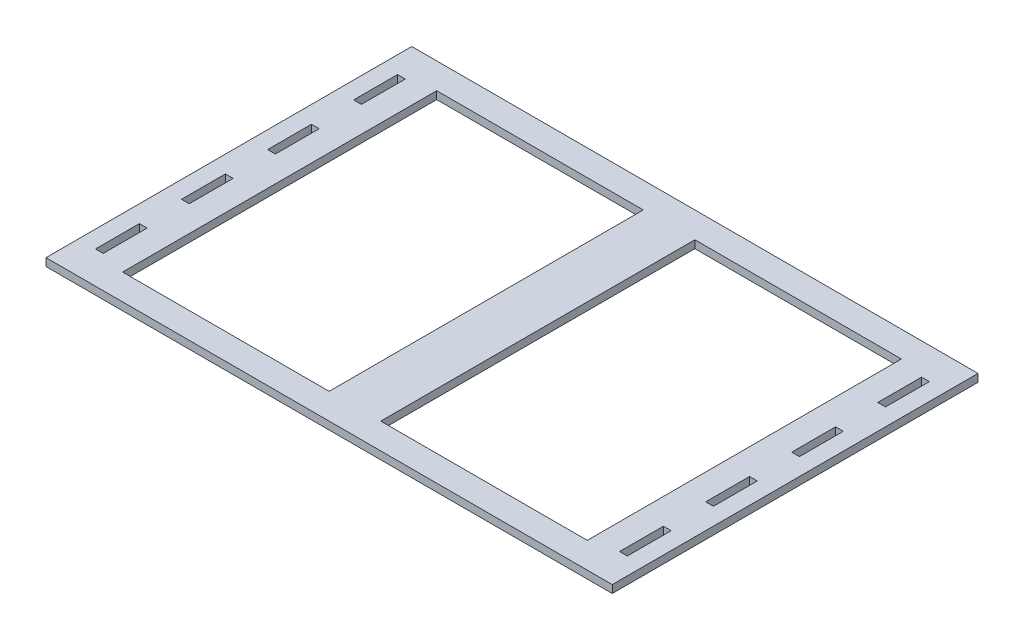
ISO-10303-21;
HEADER;
FILE_DESCRIPTION(('STEP AP214'),'2;1');
FILE_NAME('part.step','',(''),(''),'','','');
FILE_SCHEMA(('AUTOMOTIVE_DESIGN { 1 0 10303 214 1 1 1 1 }'));
ENDSEC;
DATA;
#1=APPLICATION_CONTEXT('core data for automotive mechanical design processes');
#2=APPLICATION_PROTOCOL_DEFINITION('international standard','automotive_design',2000,#1);
#3=PRODUCT_CONTEXT('',#1,'mechanical');
#4=PRODUCT('Part','Part','',(#3));
#5=PRODUCT_RELATED_PRODUCT_CATEGORY('part','',(#4));
#6=PRODUCT_DEFINITION_FORMATION('','',#4);
#7=PRODUCT_DEFINITION_CONTEXT('part definition',#1,'design');
#8=PRODUCT_DEFINITION('design','',#6,#7);
#9=PRODUCT_DEFINITION_SHAPE('','',#8);
#10=(LENGTH_UNIT() NAMED_UNIT(*) SI_UNIT(.MILLI.,.METRE.));
#11=(NAMED_UNIT(*) PLANE_ANGLE_UNIT() SI_UNIT($,.RADIAN.));
#12=(NAMED_UNIT(*) SI_UNIT($,.STERADIAN.) SOLID_ANGLE_UNIT());
#13=UNCERTAINTY_MEASURE_WITH_UNIT(LENGTH_MEASURE(1.E-05),#10,'distance_accuracy_value','');
#14=(GEOMETRIC_REPRESENTATION_CONTEXT(3) GLOBAL_UNCERTAINTY_ASSIGNED_CONTEXT((#13)) GLOBAL_UNIT_ASSIGNED_CONTEXT((#10,
#11,#12)) REPRESENTATION_CONTEXT('',''));
#15=CARTESIAN_POINT('',(0.,0.,0.));
#16=DIRECTION('',(0.,0.,1.));
#17=DIRECTION('',(1.,0.,0.));
#18=AXIS2_PLACEMENT_3D('',#15,#16,#17);
#19=CARTESIAN_POINT('',(0.,9.,0.));
#20=DIRECTION('',(0.,1.,0.));
#21=DIRECTION('',(0.,0.,1.));
#22=AXIS2_PLACEMENT_3D('',#19,#20,#21);
#23=PLANE('',#22);
#24=DIRECTION('',(0.,0.,1.));
#25=VECTOR('',#24,1.);
#26=CARTESIAN_POINT('',(-309.,9.,-76.));
#27=LINE('',#26,#25);
#28=CARTESIAN_POINT('',(-309.,9.,-76.));
#29=VERTEX_POINT('',#28);
#30=CARTESIAN_POINT('',(-309.,9.,-25.));
#31=VERTEX_POINT('',#30);
#32=EDGE_CURVE('E408',#29,#31,#27,.T.);
#33=ORIENTED_EDGE('',*,*,#32,.F.);
#34=DIRECTION('',(-1.,0.,0.));
#35=VECTOR('',#34,1.);
#36=CARTESIAN_POINT('',(-309.,9.,-76.));
#37=LINE('',#36,#35);
#38=CARTESIAN_POINT('',(-300.,9.,-76.));
#39=VERTEX_POINT('',#38);
#40=EDGE_CURVE('E400',#39,#29,#37,.T.);
#41=ORIENTED_EDGE('',*,*,#40,.F.);
#42=DIRECTION('',(0.,0.,-1.));
#43=VECTOR('',#42,1.);
#44=CARTESIAN_POINT('',(-300.,9.,-76.));
#45=LINE('',#44,#43);
#46=CARTESIAN_POINT('',(-300.,9.,-25.));
#47=VERTEX_POINT('',#46);
#48=EDGE_CURVE('E392',#47,#39,#45,.T.);
#49=ORIENTED_EDGE('',*,*,#48,.F.);
#50=DIRECTION('',(1.,0.,0.));
#51=VECTOR('',#50,1.);
#52=CARTESIAN_POINT('',(-309.,9.,-25.));
#53=LINE('',#52,#51);
#54=EDGE_CURVE('E381',#31,#47,#53,.T.);
#55=ORIENTED_EDGE('',*,*,#54,.F.);
#56=EDGE_LOOP('',(#33,#41,#49,#55));
#57=FACE_BOUND('',#56,.T.);
#58=DIRECTION('',(0.,0.,1.));
#59=VECTOR('',#58,1.);
#60=CARTESIAN_POINT('',(-309.,9.,-176.));
#61=LINE('',#60,#59);
#62=CARTESIAN_POINT('',(-309.,9.,-176.));
#63=VERTEX_POINT('',#62);
#64=CARTESIAN_POINT('',(-309.,9.,-125.));
#65=VERTEX_POINT('',#64);
#66=EDGE_CURVE('E413',#63,#65,#61,.T.);
#67=ORIENTED_EDGE('',*,*,#66,.F.);
#68=DIRECTION('',(-1.,0.,0.));
#69=VECTOR('',#68,1.);
#70=CARTESIAN_POINT('',(-309.,9.,-176.));
#71=LINE('',#70,#69);
#72=CARTESIAN_POINT('',(-300.,9.,-176.));
#73=VERTEX_POINT('',#72);
#74=EDGE_CURVE('E418',#73,#63,#71,.T.);
#75=ORIENTED_EDGE('',*,*,#74,.F.);
#76=DIRECTION('',(0.,0.,-1.));
#77=VECTOR('',#76,1.);
#78=CARTESIAN_POINT('',(-300.,9.,-176.));
#79=LINE('',#78,#77);
#80=CARTESIAN_POINT('',(-300.,9.,-125.));
#81=VERTEX_POINT('',#80);
#82=EDGE_CURVE('E432',#81,#73,#79,.T.);
#83=ORIENTED_EDGE('',*,*,#82,.F.);
#84=DIRECTION('',(1.,0.,0.));
#85=VECTOR('',#84,1.);
#86=CARTESIAN_POINT('',(-309.,9.,-125.));
#87=LINE('',#86,#85);
#88=EDGE_CURVE('E429',#65,#81,#87,.T.);
#89=ORIENTED_EDGE('',*,*,#88,.F.);
#90=EDGE_LOOP('',(#67,#75,#83,#89));
#91=FACE_BOUND('',#90,.T.);
#92=DIRECTION('',(0.,0.,1.));
#93=VECTOR('',#92,1.);
#94=CARTESIAN_POINT('',(-329.,9.,-212.5));
#95=LINE('',#94,#93);
#96=CARTESIAN_POINT('',(-329.,9.,-212.5));
#97=VERTEX_POINT('',#96);
#98=CARTESIAN_POINT('',(-329.,9.,212.5));
#99=VERTEX_POINT('',#98);
#100=EDGE_CURVE('E511',#97,#99,#95,.T.);
#101=ORIENTED_EDGE('',*,*,#100,.T.);
#102=DIRECTION('',(1.,0.,0.));
#103=VECTOR('',#102,1.);
#104=CARTESIAN_POINT('',(-329.,9.,212.5));
#105=LINE('',#104,#103);
#106=CARTESIAN_POINT('',(329.,9.,212.5));
#107=VERTEX_POINT('',#106);
#108=EDGE_CURVE('E514',#99,#107,#105,.T.);
#109=ORIENTED_EDGE('',*,*,#108,.T.);
#110=DIRECTION('',(0.,0.,-1.));
#111=VECTOR('',#110,1.);
#112=CARTESIAN_POINT('',(329.,9.,-212.5));
#113=LINE('',#112,#111);
#114=CARTESIAN_POINT('',(329.,9.,-212.5));
#115=VERTEX_POINT('',#114);
#116=EDGE_CURVE('E517',#107,#115,#113,.T.);
#117=ORIENTED_EDGE('',*,*,#116,.T.);
#118=DIRECTION('',(-1.,0.,0.));
#119=VECTOR('',#118,1.);
#120=CARTESIAN_POINT('',(-329.,9.,-212.5));
#121=LINE('',#120,#119);
#122=EDGE_CURVE('E519',#115,#97,#121,.T.);
#123=ORIENTED_EDGE('',*,*,#122,.T.);
#124=EDGE_LOOP('',(#101,#109,#117,#123));
#125=FACE_BOUND('',#124,.T.);
#126=DIRECTION('',(1.,0.,0.));
#127=VECTOR('',#126,1.);
#128=CARTESIAN_POINT('',(300.,9.,-125.));
#129=LINE('',#128,#127);
#130=CARTESIAN_POINT('',(300.,9.,-125.));
#131=VERTEX_POINT('',#130);
#132=CARTESIAN_POINT('',(309.,9.,-125.));
#133=VERTEX_POINT('',#132);
#134=EDGE_CURVE('E482',#131,#133,#129,.T.);
#135=ORIENTED_EDGE('',*,*,#134,.F.);
#136=DIRECTION('',(0.,0.,1.));
#137=VECTOR('',#136,1.);
#138=CARTESIAN_POINT('',(300.,9.,-176.));
#139=LINE('',#138,#137);
#140=CARTESIAN_POINT('',(300.,9.,-176.));
#141=VERTEX_POINT('',#140);
#142=EDGE_CURVE('E480',#141,#131,#139,.T.);
#143=ORIENTED_EDGE('',*,*,#142,.F.);
#144=DIRECTION('',(-1.,0.,0.));
#145=VECTOR('',#144,1.);
#146=CARTESIAN_POINT('',(300.,9.,-176.));
#147=LINE('',#146,#145);
#148=CARTESIAN_POINT('',(309.,9.,-176.));
#149=VERTEX_POINT('',#148);
#150=EDGE_CURVE('E488',#149,#141,#147,.T.);
#151=ORIENTED_EDGE('',*,*,#150,.F.);
#152=DIRECTION('',(0.,0.,-1.));
#153=VECTOR('',#152,1.);
#154=CARTESIAN_POINT('',(309.,9.,-176.));
#155=LINE('',#154,#153);
#156=EDGE_CURVE('E485',#133,#149,#155,.T.);
#157=ORIENTED_EDGE('',*,*,#156,.F.);
#158=EDGE_LOOP('',(#135,#143,#151,#157));
#159=FACE_BOUND('',#158,.T.);
#160=DIRECTION('',(1.,0.,0.));
#161=VECTOR('',#160,1.);
#162=CARTESIAN_POINT('',(300.,9.,-25.0000000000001));
#163=LINE('',#162,#161);
#164=CARTESIAN_POINT('',(300.,9.,-25.0000000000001));
#165=VERTEX_POINT('',#164);
#166=CARTESIAN_POINT('',(309.,9.,-25.));
#167=VERTEX_POINT('',#166);
#168=EDGE_CURVE('E470',#165,#167,#163,.T.);
#169=ORIENTED_EDGE('',*,*,#168,.F.);
#170=DIRECTION('',(0.,0.,1.));
#171=VECTOR('',#170,1.);
#172=CARTESIAN_POINT('',(300.,9.,-76.));
#173=LINE('',#172,#171);
#174=CARTESIAN_POINT('',(300.,9.,-76.));
#175=VERTEX_POINT('',#174);
#176=EDGE_CURVE('E476',#175,#165,#173,.T.);
#177=ORIENTED_EDGE('',*,*,#176,.F.);
#178=DIRECTION('',(-1.,0.,0.));
#179=VECTOR('',#178,1.);
#180=CARTESIAN_POINT('',(300.,9.,-76.));
#181=LINE('',#180,#179);
#182=CARTESIAN_POINT('',(309.,9.,-76.));
#183=VERTEX_POINT('',#182);
#184=EDGE_CURVE('E448',#183,#175,#181,.T.);
#185=ORIENTED_EDGE('',*,*,#184,.F.);
#186=DIRECTION('',(0.,0.,-1.));
#187=VECTOR('',#186,1.);
#188=CARTESIAN_POINT('',(309.,9.,-76.));
#189=LINE('',#188,#187);
#190=EDGE_CURVE('E462',#167,#183,#189,.T.);
#191=ORIENTED_EDGE('',*,*,#190,.F.);
#192=EDGE_LOOP('',(#169,#177,#185,#191));
#193=FACE_BOUND('',#192,.T.);
#194=DIRECTION('',(0.,0.,1.));
#195=VECTOR('',#194,1.);
#196=CARTESIAN_POINT('',(300.,9.,24.));
#197=LINE('',#196,#195);
#198=CARTESIAN_POINT('',(300.,9.,24.));
#199=VERTEX_POINT('',#198);
#200=CARTESIAN_POINT('',(300.,9.,74.9999999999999));
#201=VERTEX_POINT('',#200);
#202=EDGE_CURVE('E549',#199,#201,#197,.T.);
#203=ORIENTED_EDGE('',*,*,#202,.F.);
#204=DIRECTION('',(-1.,0.,0.));
#205=VECTOR('',#204,1.);
#206=CARTESIAN_POINT('',(300.,9.,24.));
#207=LINE('',#206,#205);
#208=CARTESIAN_POINT('',(309.,9.,24.));
#209=VERTEX_POINT('',#208);
#210=EDGE_CURVE('E551',#209,#199,#207,.T.);
#211=ORIENTED_EDGE('',*,*,#210,.F.);
#212=DIRECTION('',(0.,0.,-1.));
#213=VECTOR('',#212,1.);
#214=CARTESIAN_POINT('',(309.,9.,24.));
#215=LINE('',#214,#213);
#216=CARTESIAN_POINT('',(309.,9.,75.));
#217=VERTEX_POINT('',#216);
#218=EDGE_CURVE('E554',#217,#209,#215,.T.);
#219=ORIENTED_EDGE('',*,*,#218,.F.);
#220=DIRECTION('',(1.,0.,0.));
#221=VECTOR('',#220,1.);
#222=CARTESIAN_POINT('',(300.,9.,74.9999999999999));
#223=LINE('',#222,#221);
#224=EDGE_CURVE('E557',#201,#217,#223,.T.);
#225=ORIENTED_EDGE('',*,*,#224,.F.);
#226=EDGE_LOOP('',(#203,#211,#219,#225));
#227=FACE_BOUND('',#226,.T.);
#228=DIRECTION('',(0.,0.,1.));
#229=VECTOR('',#228,1.);
#230=CARTESIAN_POINT('',(300.,9.,124.));
#231=LINE('',#230,#229);
#232=CARTESIAN_POINT('',(300.,9.,124.));
#233=VERTEX_POINT('',#232);
#234=CARTESIAN_POINT('',(300.,9.,175.));
#235=VERTEX_POINT('',#234);
#236=EDGE_CURVE('E581',#233,#235,#231,.T.);
#237=ORIENTED_EDGE('',*,*,#236,.F.);
#238=DIRECTION('',(-1.,0.,0.));
#239=VECTOR('',#238,1.);
#240=CARTESIAN_POINT('',(300.,9.,124.));
#241=LINE('',#240,#239);
#242=CARTESIAN_POINT('',(309.,9.,124.));
#243=VERTEX_POINT('',#242);
#244=EDGE_CURVE('E583',#243,#233,#241,.T.);
#245=ORIENTED_EDGE('',*,*,#244,.F.);
#246=DIRECTION('',(0.,0.,-1.));
#247=VECTOR('',#246,1.);
#248=CARTESIAN_POINT('',(309.,9.,124.));
#249=LINE('',#248,#247);
#250=CARTESIAN_POINT('',(309.,9.,175.));
#251=VERTEX_POINT('',#250);
#252=EDGE_CURVE('E586',#251,#243,#249,.T.);
#253=ORIENTED_EDGE('',*,*,#252,.F.);
#254=DIRECTION('',(1.,0.,0.));
#255=VECTOR('',#254,1.);
#256=CARTESIAN_POINT('',(300.,9.,175.));
#257=LINE('',#256,#255);
#258=EDGE_CURVE('E589',#235,#251,#257,.T.);
#259=ORIENTED_EDGE('',*,*,#258,.F.);
#260=EDGE_LOOP('',(#237,#245,#253,#259));
#261=FACE_BOUND('',#260,.T.);
#262=DIRECTION('',(0.,0.,1.));
#263=VECTOR('',#262,1.);
#264=CARTESIAN_POINT('',(-309.,9.,24.));
#265=LINE('',#264,#263);
#266=CARTESIAN_POINT('',(-309.,9.,24.));
#267=VERTEX_POINT('',#266);
#268=CARTESIAN_POINT('',(-309.,9.,75.));
#269=VERTEX_POINT('',#268);
#270=EDGE_CURVE('E604',#267,#269,#265,.T.);
#271=ORIENTED_EDGE('',*,*,#270,.F.);
#272=DIRECTION('',(-1.,0.,0.));
#273=VECTOR('',#272,1.);
#274=CARTESIAN_POINT('',(-309.,9.,24.));
#275=LINE('',#274,#273);
#276=CARTESIAN_POINT('',(-300.,9.,24.));
#277=VERTEX_POINT('',#276);
#278=EDGE_CURVE('E606',#277,#267,#275,.T.);
#279=ORIENTED_EDGE('',*,*,#278,.F.);
#280=DIRECTION('',(0.,0.,-1.));
#281=VECTOR('',#280,1.);
#282=CARTESIAN_POINT('',(-300.,9.,24.));
#283=LINE('',#282,#281);
#284=CARTESIAN_POINT('',(-300.,9.,75.));
#285=VERTEX_POINT('',#284);
#286=EDGE_CURVE('E609',#285,#277,#283,.T.);
#287=ORIENTED_EDGE('',*,*,#286,.F.);
#288=DIRECTION('',(1.,0.,0.));
#289=VECTOR('',#288,1.);
#290=CARTESIAN_POINT('',(-309.,9.,75.));
#291=LINE('',#290,#289);
#292=EDGE_CURVE('E612',#269,#285,#291,.T.);
#293=ORIENTED_EDGE('',*,*,#292,.F.);
#294=EDGE_LOOP('',(#271,#279,#287,#293));
#295=FACE_BOUND('',#294,.T.);
#296=DIRECTION('',(0.,0.,1.));
#297=VECTOR('',#296,1.);
#298=CARTESIAN_POINT('',(-309.,9.,124.));
#299=LINE('',#298,#297);
#300=CARTESIAN_POINT('',(-309.,9.,124.));
#301=VERTEX_POINT('',#300);
#302=CARTESIAN_POINT('',(-309.,9.,175.));
#303=VERTEX_POINT('',#302);
#304=EDGE_CURVE('E636',#301,#303,#299,.T.);
#305=ORIENTED_EDGE('',*,*,#304,.F.);
#306=DIRECTION('',(-1.,0.,0.));
#307=VECTOR('',#306,1.);
#308=CARTESIAN_POINT('',(-309.,9.,124.));
#309=LINE('',#308,#307);
#310=CARTESIAN_POINT('',(-300.,9.,124.));
#311=VERTEX_POINT('',#310);
#312=EDGE_CURVE('E638',#311,#301,#309,.T.);
#313=ORIENTED_EDGE('',*,*,#312,.F.);
#314=DIRECTION('',(0.,0.,-1.));
#315=VECTOR('',#314,1.);
#316=CARTESIAN_POINT('',(-300.,9.,124.));
#317=LINE('',#316,#315);
#318=CARTESIAN_POINT('',(-300.,9.,175.));
#319=VERTEX_POINT('',#318);
#320=EDGE_CURVE('E641',#319,#311,#317,.T.);
#321=ORIENTED_EDGE('',*,*,#320,.F.);
#322=DIRECTION('',(1.,0.,0.));
#323=VECTOR('',#322,1.);
#324=CARTESIAN_POINT('',(-309.,9.,175.));
#325=LINE('',#324,#323);
#326=EDGE_CURVE('E644',#303,#319,#325,.T.);
#327=ORIENTED_EDGE('',*,*,#326,.F.);
#328=EDGE_LOOP('',(#305,#313,#321,#327));
#329=FACE_BOUND('',#328,.T.);
#330=DIRECTION('',(1.,0.,0.));
#331=VECTOR('',#330,1.);
#332=CARTESIAN_POINT('',(-270.,9.,182.5));
#333=LINE('',#332,#331);
#334=CARTESIAN_POINT('',(-270.,9.,182.5));
#335=VERTEX_POINT('',#334);
#336=CARTESIAN_POINT('',(-29.9999999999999,9.,182.5));
#337=VERTEX_POINT('',#336);
#338=EDGE_CURVE('E353',#335,#337,#333,.T.);
#339=ORIENTED_EDGE('',*,*,#338,.F.);
#340=DIRECTION('',(0.,0.,1.));
#341=VECTOR('',#340,1.);
#342=CARTESIAN_POINT('',(-270.,9.,-182.5));
#343=LINE('',#342,#341);
#344=CARTESIAN_POINT('',(-270.,9.,-182.5));
#345=VERTEX_POINT('',#344);
#346=EDGE_CURVE('E351',#345,#335,#343,.T.);
#347=ORIENTED_EDGE('',*,*,#346,.F.);
#348=DIRECTION('',(-1.,0.,0.));
#349=VECTOR('',#348,1.);
#350=CARTESIAN_POINT('',(-270.,9.,-182.5));
#351=LINE('',#350,#349);
#352=CARTESIAN_POINT('',(-30.,9.,-182.5));
#353=VERTEX_POINT('',#352);
#354=EDGE_CURVE('E359',#353,#345,#351,.T.);
#355=ORIENTED_EDGE('',*,*,#354,.F.);
#356=DIRECTION('',(0.,0.,-1.));
#357=VECTOR('',#356,1.);
#358=CARTESIAN_POINT('',(-30.,9.,-182.5));
#359=LINE('',#358,#357);
#360=EDGE_CURVE('E356',#337,#353,#359,.T.);
#361=ORIENTED_EDGE('',*,*,#360,.F.);
#362=EDGE_LOOP('',(#339,#347,#355,#361));
#363=FACE_BOUND('',#362,.T.);
#364=DIRECTION('',(1.,0.,0.));
#365=VECTOR('',#364,1.);
#366=CARTESIAN_POINT('',(30.0000000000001,9.,182.5));
#367=LINE('',#366,#365);
#368=CARTESIAN_POINT('',(30.0000000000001,9.,182.5));
#369=VERTEX_POINT('',#368);
#370=CARTESIAN_POINT('',(270.,9.,182.5));
#371=VERTEX_POINT('',#370);
#372=EDGE_CURVE('E323',#369,#371,#367,.T.);
#373=ORIENTED_EDGE('',*,*,#372,.F.);
#374=DIRECTION('',(0.,0.,1.));
#375=VECTOR('',#374,1.);
#376=CARTESIAN_POINT('',(30.0000000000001,9.,-182.5));
#377=LINE('',#376,#375);
#378=CARTESIAN_POINT('',(30.0000000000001,9.,-182.5));
#379=VERTEX_POINT('',#378);
#380=EDGE_CURVE('E315',#379,#369,#377,.T.);
#381=ORIENTED_EDGE('',*,*,#380,.F.);
#382=DIRECTION('',(-1.,0.,0.));
#383=VECTOR('',#382,1.);
#384=CARTESIAN_POINT('',(30.0000000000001,9.,-182.5));
#385=LINE('',#384,#383);
#386=CARTESIAN_POINT('',(270.,9.,-182.5));
#387=VERTEX_POINT('',#386);
#388=EDGE_CURVE('E337',#387,#379,#385,.T.);
#389=ORIENTED_EDGE('',*,*,#388,.F.);
#390=DIRECTION('',(0.,0.,-1.));
#391=VECTOR('',#390,1.);
#392=CARTESIAN_POINT('',(270.,9.,-182.5));
#393=LINE('',#392,#391);
#394=EDGE_CURVE('E335',#371,#387,#393,.T.);
#395=ORIENTED_EDGE('',*,*,#394,.F.);
#396=EDGE_LOOP('',(#373,#381,#389,#395));
#397=FACE_BOUND('',#396,.T.);
#398=ADVANCED_FACE('F34',(#57,#91,#125,#159,#193,#227,#261,#295,#329,#363,#397),#23,.T.);
#399=CARTESIAN_POINT('',(0.,0.,0.));
#400=DIRECTION('',(0.,1.,0.));
#401=DIRECTION('',(0.,0.,1.));
#402=AXIS2_PLACEMENT_3D('',#399,#400,#401);
#403=PLANE('',#402);
#404=DIRECTION('',(0.,0.,1.));
#405=VECTOR('',#404,1.);
#406=CARTESIAN_POINT('',(-270.,0.,-182.5));
#407=LINE('',#406,#405);
#408=CARTESIAN_POINT('',(-270.,0.,-182.5));
#409=VERTEX_POINT('',#408);
#410=CARTESIAN_POINT('',(-270.,0.,182.5));
#411=VERTEX_POINT('',#410);
#412=EDGE_CURVE('E331',#409,#411,#407,.T.);
#413=ORIENTED_EDGE('',*,*,#412,.T.);
#414=DIRECTION('',(1.,0.,0.));
#415=VECTOR('',#414,1.);
#416=CARTESIAN_POINT('',(-270.,0.,182.5));
#417=LINE('',#416,#415);
#418=CARTESIAN_POINT('',(-29.9999999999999,0.,182.5));
#419=VERTEX_POINT('',#418);
#420=EDGE_CURVE('E364',#411,#419,#417,.T.);
#421=ORIENTED_EDGE('',*,*,#420,.T.);
#422=DIRECTION('',(0.,0.,-1.));
#423=VECTOR('',#422,1.);
#424=CARTESIAN_POINT('',(-30.,0.,-182.5));
#425=LINE('',#424,#423);
#426=CARTESIAN_POINT('',(-30.,0.,-182.5));
#427=VERTEX_POINT('',#426);
#428=EDGE_CURVE('E367',#419,#427,#425,.T.);
#429=ORIENTED_EDGE('',*,*,#428,.T.);
#430=DIRECTION('',(-1.,0.,0.));
#431=VECTOR('',#430,1.);
#432=CARTESIAN_POINT('',(-270.,0.,-182.5));
#433=LINE('',#432,#431);
#434=EDGE_CURVE('E354',#427,#409,#433,.T.);
#435=ORIENTED_EDGE('',*,*,#434,.T.);
#436=EDGE_LOOP('',(#413,#421,#429,#435));
#437=FACE_BOUND('',#436,.T.);
#438=DIRECTION('',(-1.,0.,0.));
#439=VECTOR('',#438,1.);
#440=CARTESIAN_POINT('',(-309.,0.,-76.));
#441=LINE('',#440,#439);
#442=CARTESIAN_POINT('',(-300.,0.,-76.));
#443=VERTEX_POINT('',#442);
#444=CARTESIAN_POINT('',(-309.,0.,-76.));
#445=VERTEX_POINT('',#444);
#446=EDGE_CURVE('E405',#443,#445,#441,.T.);
#447=ORIENTED_EDGE('',*,*,#446,.T.);
#448=DIRECTION('',(0.,0.,1.));
#449=VECTOR('',#448,1.);
#450=CARTESIAN_POINT('',(-309.,0.,-76.));
#451=LINE('',#450,#449);
#452=CARTESIAN_POINT('',(-309.,0.,-25.));
#453=VERTEX_POINT('',#452);
#454=EDGE_CURVE('E410',#445,#453,#451,.T.);
#455=ORIENTED_EDGE('',*,*,#454,.T.);
#456=DIRECTION('',(1.,0.,0.));
#457=VECTOR('',#456,1.);
#458=CARTESIAN_POINT('',(-309.,0.,-25.));
#459=LINE('',#458,#457);
#460=CARTESIAN_POINT('',(-300.,0.,-25.));
#461=VERTEX_POINT('',#460);
#462=EDGE_CURVE('E383',#453,#461,#459,.T.);
#463=ORIENTED_EDGE('',*,*,#462,.T.);
#464=DIRECTION('',(0.,0.,-1.));
#465=VECTOR('',#464,1.);
#466=CARTESIAN_POINT('',(-300.,0.,-76.));
#467=LINE('',#466,#465);
#468=EDGE_CURVE('E397',#461,#443,#467,.T.);
#469=ORIENTED_EDGE('',*,*,#468,.T.);
#470=EDGE_LOOP('',(#447,#455,#463,#469));
#471=FACE_BOUND('',#470,.T.);
#472=DIRECTION('',(-1.,0.,0.));
#473=VECTOR('',#472,1.);
#474=CARTESIAN_POINT('',(-309.,0.,-176.));
#475=LINE('',#474,#473);
#476=CARTESIAN_POINT('',(-300.,0.,-176.));
#477=VERTEX_POINT('',#476);
#478=CARTESIAN_POINT('',(-309.,0.,-176.));
#479=VERTEX_POINT('',#478);
#480=EDGE_CURVE('E424',#477,#479,#475,.T.);
#481=ORIENTED_EDGE('',*,*,#480,.T.);
#482=DIRECTION('',(0.,0.,1.));
#483=VECTOR('',#482,1.);
#484=CARTESIAN_POINT('',(-309.,0.,-176.));
#485=LINE('',#484,#483);
#486=CARTESIAN_POINT('',(-309.,0.,-125.));
#487=VERTEX_POINT('',#486);
#488=EDGE_CURVE('E414',#479,#487,#485,.T.);
#489=ORIENTED_EDGE('',*,*,#488,.T.);
#490=DIRECTION('',(1.,0.,0.));
#491=VECTOR('',#490,1.);
#492=CARTESIAN_POINT('',(-309.,0.,-125.));
#493=LINE('',#492,#491);
#494=CARTESIAN_POINT('',(-300.,0.,-125.));
#495=VERTEX_POINT('',#494);
#496=EDGE_CURVE('E417',#487,#495,#493,.T.);
#497=ORIENTED_EDGE('',*,*,#496,.T.);
#498=DIRECTION('',(0.,0.,-1.));
#499=VECTOR('',#498,1.);
#500=CARTESIAN_POINT('',(-300.,0.,-176.));
#501=LINE('',#500,#499);
#502=EDGE_CURVE('E421',#495,#477,#501,.T.);
#503=ORIENTED_EDGE('',*,*,#502,.T.);
#504=EDGE_LOOP('',(#481,#489,#497,#503));
#505=FACE_BOUND('',#504,.T.);
#506=DIRECTION('',(0.,0.,1.));
#507=VECTOR('',#506,1.);
#508=CARTESIAN_POINT('',(300.,0.,-176.));
#509=LINE('',#508,#507);
#510=CARTESIAN_POINT('',(300.,0.,-176.));
#511=VERTEX_POINT('',#510);
#512=CARTESIAN_POINT('',(300.,0.,-125.));
#513=VERTEX_POINT('',#512);
#514=EDGE_CURVE('E479',#511,#513,#509,.T.);
#515=ORIENTED_EDGE('',*,*,#514,.T.);
#516=DIRECTION('',(1.,0.,0.));
#517=VECTOR('',#516,1.);
#518=CARTESIAN_POINT('',(300.,0.,-125.));
#519=LINE('',#518,#517);
#520=CARTESIAN_POINT('',(309.,0.,-125.));
#521=VERTEX_POINT('',#520);
#522=EDGE_CURVE('E493',#513,#521,#519,.T.);
#523=ORIENTED_EDGE('',*,*,#522,.T.);
#524=DIRECTION('',(0.,0.,-1.));
#525=VECTOR('',#524,1.);
#526=CARTESIAN_POINT('',(309.,0.,-176.));
#527=LINE('',#526,#525);
#528=CARTESIAN_POINT('',(309.,0.,-176.));
#529=VERTEX_POINT('',#528);
#530=EDGE_CURVE('E496',#521,#529,#527,.T.);
#531=ORIENTED_EDGE('',*,*,#530,.T.);
#532=DIRECTION('',(-1.,0.,0.));
#533=VECTOR('',#532,1.);
#534=CARTESIAN_POINT('',(300.,0.,-176.));
#535=LINE('',#534,#533);
#536=EDGE_CURVE('E483',#529,#511,#535,.T.);
#537=ORIENTED_EDGE('',*,*,#536,.T.);
#538=EDGE_LOOP('',(#515,#523,#531,#537));
#539=FACE_BOUND('',#538,.T.);
#540=DIRECTION('',(0.,0.,1.));
#541=VECTOR('',#540,1.);
#542=CARTESIAN_POINT('',(-329.,0.,-212.5));
#543=LINE('',#542,#541);
#544=CARTESIAN_POINT('',(-329.,0.,-212.5));
#545=VERTEX_POINT('',#544);
#546=CARTESIAN_POINT('',(-329.,0.,212.5));
#547=VERTEX_POINT('',#546);
#548=EDGE_CURVE('E510',#545,#547,#543,.T.);
#549=ORIENTED_EDGE('',*,*,#548,.F.);
#550=DIRECTION('',(-1.,0.,0.));
#551=VECTOR('',#550,1.);
#552=CARTESIAN_POINT('',(-329.,0.,-212.5));
#553=LINE('',#552,#551);
#554=CARTESIAN_POINT('',(329.,0.,-212.5));
#555=VERTEX_POINT('',#554);
#556=EDGE_CURVE('E515',#555,#545,#553,.T.);
#557=ORIENTED_EDGE('',*,*,#556,.F.);
#558=DIRECTION('',(0.,0.,-1.));
#559=VECTOR('',#558,1.);
#560=CARTESIAN_POINT('',(329.,0.,-212.5));
#561=LINE('',#560,#559);
#562=CARTESIAN_POINT('',(329.,0.,212.5));
#563=VERTEX_POINT('',#562);
#564=EDGE_CURVE('E526',#563,#555,#561,.T.);
#565=ORIENTED_EDGE('',*,*,#564,.F.);
#566=DIRECTION('',(1.,0.,0.));
#567=VECTOR('',#566,1.);
#568=CARTESIAN_POINT('',(-329.,0.,212.5));
#569=LINE('',#568,#567);
#570=EDGE_CURVE('E524',#547,#563,#569,.T.);
#571=ORIENTED_EDGE('',*,*,#570,.F.);
#572=EDGE_LOOP('',(#549,#557,#565,#571));
#573=FACE_BOUND('',#572,.T.);
#574=DIRECTION('',(0.,0.,1.));
#575=VECTOR('',#574,1.);
#576=CARTESIAN_POINT('',(300.,0.,-76.));
#577=LINE('',#576,#575);
#578=CARTESIAN_POINT('',(300.,0.,-76.));
#579=VERTEX_POINT('',#578);
#580=CARTESIAN_POINT('',(300.,0.,-25.0000000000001));
#581=VERTEX_POINT('',#580);
#582=EDGE_CURVE('E473',#579,#581,#577,.T.);
#583=ORIENTED_EDGE('',*,*,#582,.T.);
#584=DIRECTION('',(1.,0.,0.));
#585=VECTOR('',#584,1.);
#586=CARTESIAN_POINT('',(300.,0.,-25.0000000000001));
#587=LINE('',#586,#585);
#588=CARTESIAN_POINT('',(309.,0.,-25.));
#589=VERTEX_POINT('',#588);
#590=EDGE_CURVE('E464',#581,#589,#587,.T.);
#591=ORIENTED_EDGE('',*,*,#590,.T.);
#592=DIRECTION('',(0.,0.,-1.));
#593=VECTOR('',#592,1.);
#594=CARTESIAN_POINT('',(309.,0.,-76.));
#595=LINE('',#594,#593);
#596=CARTESIAN_POINT('',(309.,0.,-76.));
#597=VERTEX_POINT('',#596);
#598=EDGE_CURVE('E456',#589,#597,#595,.T.);
#599=ORIENTED_EDGE('',*,*,#598,.T.);
#600=DIRECTION('',(-1.,0.,0.));
#601=VECTOR('',#600,1.);
#602=CARTESIAN_POINT('',(300.,0.,-76.));
#603=LINE('',#602,#601);
#604=EDGE_CURVE('E439',#597,#579,#603,.T.);
#605=ORIENTED_EDGE('',*,*,#604,.T.);
#606=EDGE_LOOP('',(#583,#591,#599,#605));
#607=FACE_BOUND('',#606,.T.);
#608=DIRECTION('',(0.,0.,1.));
#609=VECTOR('',#608,1.);
#610=CARTESIAN_POINT('',(300.,0.,24.));
#611=LINE('',#610,#609);
#612=CARTESIAN_POINT('',(300.,0.,24.));
#613=VERTEX_POINT('',#612);
#614=CARTESIAN_POINT('',(300.,0.,74.9999999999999));
#615=VERTEX_POINT('',#614);
#616=EDGE_CURVE('E540',#613,#615,#611,.T.);
#617=ORIENTED_EDGE('',*,*,#616,.T.);
#618=DIRECTION('',(1.,0.,0.));
#619=VECTOR('',#618,1.);
#620=CARTESIAN_POINT('',(300.,0.,74.9999999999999));
#621=LINE('',#620,#619);
#622=CARTESIAN_POINT('',(309.,0.,75.));
#623=VERTEX_POINT('',#622);
#624=EDGE_CURVE('E542',#615,#623,#621,.T.);
#625=ORIENTED_EDGE('',*,*,#624,.T.);
#626=DIRECTION('',(0.,0.,-1.));
#627=VECTOR('',#626,1.);
#628=CARTESIAN_POINT('',(309.,0.,24.));
#629=LINE('',#628,#627);
#630=CARTESIAN_POINT('',(309.,0.,24.));
#631=VERTEX_POINT('',#630);
#632=EDGE_CURVE('E544',#623,#631,#629,.T.);
#633=ORIENTED_EDGE('',*,*,#632,.T.);
#634=DIRECTION('',(-1.,0.,0.));
#635=VECTOR('',#634,1.);
#636=CARTESIAN_POINT('',(300.,0.,24.));
#637=LINE('',#636,#635);
#638=EDGE_CURVE('E546',#631,#613,#637,.T.);
#639=ORIENTED_EDGE('',*,*,#638,.T.);
#640=EDGE_LOOP('',(#617,#625,#633,#639));
#641=FACE_BOUND('',#640,.T.);
#642=DIRECTION('',(0.,0.,1.));
#643=VECTOR('',#642,1.);
#644=CARTESIAN_POINT('',(300.,0.,124.));
#645=LINE('',#644,#643);
#646=CARTESIAN_POINT('',(300.,0.,124.));
#647=VERTEX_POINT('',#646);
#648=CARTESIAN_POINT('',(300.,0.,175.));
#649=VERTEX_POINT('',#648);
#650=EDGE_CURVE('E572',#647,#649,#645,.T.);
#651=ORIENTED_EDGE('',*,*,#650,.T.);
#652=DIRECTION('',(1.,0.,0.));
#653=VECTOR('',#652,1.);
#654=CARTESIAN_POINT('',(300.,0.,175.));
#655=LINE('',#654,#653);
#656=CARTESIAN_POINT('',(309.,0.,175.));
#657=VERTEX_POINT('',#656);
#658=EDGE_CURVE('E574',#649,#657,#655,.T.);
#659=ORIENTED_EDGE('',*,*,#658,.T.);
#660=DIRECTION('',(0.,0.,-1.));
#661=VECTOR('',#660,1.);
#662=CARTESIAN_POINT('',(309.,0.,124.));
#663=LINE('',#662,#661);
#664=CARTESIAN_POINT('',(309.,0.,124.));
#665=VERTEX_POINT('',#664);
#666=EDGE_CURVE('E576',#657,#665,#663,.T.);
#667=ORIENTED_EDGE('',*,*,#666,.T.);
#668=DIRECTION('',(-1.,0.,0.));
#669=VECTOR('',#668,1.);
#670=CARTESIAN_POINT('',(300.,0.,124.));
#671=LINE('',#670,#669);
#672=EDGE_CURVE('E578',#665,#647,#671,.T.);
#673=ORIENTED_EDGE('',*,*,#672,.T.);
#674=EDGE_LOOP('',(#651,#659,#667,#673));
#675=FACE_BOUND('',#674,.T.);
#676=DIRECTION('',(0.,0.,1.));
#677=VECTOR('',#676,1.);
#678=CARTESIAN_POINT('',(-309.,0.,24.));
#679=LINE('',#678,#677);
#680=CARTESIAN_POINT('',(-309.,0.,24.));
#681=VERTEX_POINT('',#680);
#682=CARTESIAN_POINT('',(-309.,0.,75.));
#683=VERTEX_POINT('',#682);
#684=EDGE_CURVE('E615',#681,#683,#679,.T.);
#685=ORIENTED_EDGE('',*,*,#684,.T.);
#686=DIRECTION('',(1.,0.,0.));
#687=VECTOR('',#686,1.);
#688=CARTESIAN_POINT('',(-309.,0.,75.));
#689=LINE('',#688,#687);
#690=CARTESIAN_POINT('',(-300.,0.,75.));
#691=VERTEX_POINT('',#690);
#692=EDGE_CURVE('E617',#683,#691,#689,.T.);
#693=ORIENTED_EDGE('',*,*,#692,.T.);
#694=DIRECTION('',(0.,0.,-1.));
#695=VECTOR('',#694,1.);
#696=CARTESIAN_POINT('',(-300.,0.,24.));
#697=LINE('',#696,#695);
#698=CARTESIAN_POINT('',(-300.,0.,24.));
#699=VERTEX_POINT('',#698);
#700=EDGE_CURVE('E619',#691,#699,#697,.T.);
#701=ORIENTED_EDGE('',*,*,#700,.T.);
#702=DIRECTION('',(-1.,0.,0.));
#703=VECTOR('',#702,1.);
#704=CARTESIAN_POINT('',(-309.,0.,24.));
#705=LINE('',#704,#703);
#706=EDGE_CURVE('E621',#699,#681,#705,.T.);
#707=ORIENTED_EDGE('',*,*,#706,.T.);
#708=EDGE_LOOP('',(#685,#693,#701,#707));
#709=FACE_BOUND('',#708,.T.);
#710=DIRECTION('',(0.,0.,1.));
#711=VECTOR('',#710,1.);
#712=CARTESIAN_POINT('',(-309.,0.,124.));
#713=LINE('',#712,#711);
#714=CARTESIAN_POINT('',(-309.,0.,124.));
#715=VERTEX_POINT('',#714);
#716=CARTESIAN_POINT('',(-309.,0.,175.));
#717=VERTEX_POINT('',#716);
#718=EDGE_CURVE('E647',#715,#717,#713,.T.);
#719=ORIENTED_EDGE('',*,*,#718,.T.);
#720=DIRECTION('',(1.,0.,0.));
#721=VECTOR('',#720,1.);
#722=CARTESIAN_POINT('',(-309.,0.,175.));
#723=LINE('',#722,#721);
#724=CARTESIAN_POINT('',(-300.,0.,175.));
#725=VERTEX_POINT('',#724);
#726=EDGE_CURVE('E649',#717,#725,#723,.T.);
#727=ORIENTED_EDGE('',*,*,#726,.T.);
#728=DIRECTION('',(0.,0.,-1.));
#729=VECTOR('',#728,1.);
#730=CARTESIAN_POINT('',(-300.,0.,124.));
#731=LINE('',#730,#729);
#732=CARTESIAN_POINT('',(-300.,0.,124.));
#733=VERTEX_POINT('',#732);
#734=EDGE_CURVE('E651',#725,#733,#731,.T.);
#735=ORIENTED_EDGE('',*,*,#734,.T.);
#736=DIRECTION('',(-1.,0.,0.));
#737=VECTOR('',#736,1.);
#738=CARTESIAN_POINT('',(-309.,0.,124.));
#739=LINE('',#738,#737);
#740=EDGE_CURVE('E653',#733,#715,#739,.T.);
#741=ORIENTED_EDGE('',*,*,#740,.T.);
#742=EDGE_LOOP('',(#719,#727,#735,#741));
#743=FACE_BOUND('',#742,.T.);
#744=DIRECTION('',(0.,0.,1.));
#745=VECTOR('',#744,1.);
#746=CARTESIAN_POINT('',(30.0000000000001,0.,-182.5));
#747=LINE('',#746,#745);
#748=CARTESIAN_POINT('',(30.0000000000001,0.,-182.5));
#749=VERTEX_POINT('',#748);
#750=CARTESIAN_POINT('',(30.0000000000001,0.,182.5));
#751=VERTEX_POINT('',#750);
#752=EDGE_CURVE('E57',#749,#751,#747,.T.);
#753=ORIENTED_EDGE('',*,*,#752,.T.);
#754=DIRECTION('',(1.,0.,0.));
#755=VECTOR('',#754,1.);
#756=CARTESIAN_POINT('',(30.0000000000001,0.,182.5));
#757=LINE('',#756,#755);
#758=CARTESIAN_POINT('',(270.,0.,182.5));
#759=VERTEX_POINT('',#758);
#760=EDGE_CURVE('E330',#751,#759,#757,.T.);
#761=ORIENTED_EDGE('',*,*,#760,.T.);
#762=DIRECTION('',(0.,0.,-1.));
#763=VECTOR('',#762,1.);
#764=CARTESIAN_POINT('',(270.,0.,-182.5));
#765=LINE('',#764,#763);
#766=CARTESIAN_POINT('',(270.,0.,-182.5));
#767=VERTEX_POINT('',#766);
#768=EDGE_CURVE('E343',#759,#767,#765,.T.);
#769=ORIENTED_EDGE('',*,*,#768,.T.);
#770=DIRECTION('',(-1.,0.,0.));
#771=VECTOR('',#770,1.);
#772=CARTESIAN_POINT('',(30.0000000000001,0.,-182.5));
#773=LINE('',#772,#771);
#774=EDGE_CURVE('E324',#767,#749,#773,.T.);
#775=ORIENTED_EDGE('',*,*,#774,.T.);
#776=EDGE_LOOP('',(#753,#761,#769,#775));
#777=FACE_BOUND('',#776,.T.);
#778=ADVANCED_FACE('F680',(#437,#471,#505,#539,#573,#607,#641,#675,#709,#743,#777),#403,.F.);
#779=CARTESIAN_POINT('',(-309.,0.,175.));
#780=DIRECTION('',(0.,0.,1.));
#781=DIRECTION('',(1.,0.,0.));
#782=AXIS2_PLACEMENT_3D('',#779,#780,#781);
#783=PLANE('',#782);
#784=ORIENTED_EDGE('',*,*,#326,.T.);
#785=DIRECTION('',(0.,1.,0.));
#786=VECTOR('',#785,1.);
#787=CARTESIAN_POINT('',(-300.,0.,175.));
#788=LINE('',#787,#786);
#789=EDGE_CURVE('E11',#725,#319,#788,.T.);
#790=ORIENTED_EDGE('',*,*,#789,.F.);
#791=ORIENTED_EDGE('',*,*,#726,.F.);
#792=DIRECTION('',(0.,1.,0.));
#793=VECTOR('',#792,1.);
#794=CARTESIAN_POINT('',(-309.,0.,175.));
#795=LINE('',#794,#793);
#796=EDGE_CURVE('E656',#717,#303,#795,.T.);
#797=ORIENTED_EDGE('',*,*,#796,.T.);
#798=EDGE_LOOP('',(#784,#790,#791,#797));
#799=FACE_BOUND('',#798,.T.);
#800=ADVANCED_FACE('F36',(#799),#783,.F.);
#801=CARTESIAN_POINT('',(-300.,0.,124.));
#802=DIRECTION('',(1.,0.,0.));
#803=DIRECTION('',(0.,0.,-1.));
#804=AXIS2_PLACEMENT_3D('',#801,#802,#803);
#805=PLANE('',#804);
#806=ORIENTED_EDGE('',*,*,#320,.T.);
#807=DIRECTION('',(0.,1.,0.));
#808=VECTOR('',#807,1.);
#809=CARTESIAN_POINT('',(-300.,0.,124.));
#810=LINE('',#809,#808);
#811=EDGE_CURVE('E42',#733,#311,#810,.T.);
#812=ORIENTED_EDGE('',*,*,#811,.F.);
#813=ORIENTED_EDGE('',*,*,#734,.F.);
#814=ORIENTED_EDGE('',*,*,#789,.T.);
#815=EDGE_LOOP('',(#806,#812,#813,#814));
#816=FACE_BOUND('',#815,.T.);
#817=ADVANCED_FACE('F669',(#816),#805,.F.);
#818=CARTESIAN_POINT('',(-309.,0.,124.));
#819=DIRECTION('',(0.,0.,-1.));
#820=DIRECTION('',(-1.,0.,0.));
#821=AXIS2_PLACEMENT_3D('',#818,#819,#820);
#822=PLANE('',#821);
#823=ORIENTED_EDGE('',*,*,#312,.T.);
#824=DIRECTION('',(0.,1.,0.));
#825=VECTOR('',#824,1.);
#826=CARTESIAN_POINT('',(-309.,0.,124.));
#827=LINE('',#826,#825);
#828=EDGE_CURVE('E659',#715,#301,#827,.T.);
#829=ORIENTED_EDGE('',*,*,#828,.F.);
#830=ORIENTED_EDGE('',*,*,#740,.F.);
#831=ORIENTED_EDGE('',*,*,#811,.T.);
#832=EDGE_LOOP('',(#823,#829,#830,#831));
#833=FACE_BOUND('',#832,.T.);
#834=ADVANCED_FACE('F665',(#833),#822,.F.);
#835=CARTESIAN_POINT('',(-309.,0.,124.));
#836=DIRECTION('',(-1.,0.,0.));
#837=DIRECTION('',(0.,0.,1.));
#838=AXIS2_PLACEMENT_3D('',#835,#836,#837);
#839=PLANE('',#838);
#840=ORIENTED_EDGE('',*,*,#304,.T.);
#841=ORIENTED_EDGE('',*,*,#796,.F.);
#842=ORIENTED_EDGE('',*,*,#718,.F.);
#843=ORIENTED_EDGE('',*,*,#828,.T.);
#844=EDGE_LOOP('',(#840,#841,#842,#843));
#845=FACE_BOUND('',#844,.T.);
#846=ADVANCED_FACE('F678',(#845),#839,.F.);
#847=CARTESIAN_POINT('',(-309.,0.,75.));
#848=DIRECTION('',(0.,0.,1.));
#849=DIRECTION('',(1.,0.,0.));
#850=AXIS2_PLACEMENT_3D('',#847,#848,#849);
#851=PLANE('',#850);
#852=ORIENTED_EDGE('',*,*,#292,.T.);
#853=DIRECTION('',(0.,1.,0.));
#854=VECTOR('',#853,1.);
#855=CARTESIAN_POINT('',(-300.,0.,75.));
#856=LINE('',#855,#854);
#857=EDGE_CURVE('E633',#691,#285,#856,.T.);
#858=ORIENTED_EDGE('',*,*,#857,.F.);
#859=ORIENTED_EDGE('',*,*,#692,.F.);
#860=DIRECTION('',(0.,1.,0.));
#861=VECTOR('',#860,1.);
#862=CARTESIAN_POINT('',(-309.,0.,75.));
#863=LINE('',#862,#861);
#864=EDGE_CURVE('E624',#683,#269,#863,.T.);
#865=ORIENTED_EDGE('',*,*,#864,.T.);
#866=EDGE_LOOP('',(#852,#858,#859,#865));
#867=FACE_BOUND('',#866,.T.);
#868=ADVANCED_FACE('F765',(#867),#851,.F.);
#869=CARTESIAN_POINT('',(-300.,0.,24.));
#870=DIRECTION('',(1.,0.,0.));
#871=DIRECTION('',(0.,0.,-1.));
#872=AXIS2_PLACEMENT_3D('',#869,#870,#871);
#873=PLANE('',#872);
#874=ORIENTED_EDGE('',*,*,#286,.T.);
#875=DIRECTION('',(0.,1.,0.));
#876=VECTOR('',#875,1.);
#877=CARTESIAN_POINT('',(-300.,0.,24.));
#878=LINE('',#877,#876);
#879=EDGE_CURVE('E630',#699,#277,#878,.T.);
#880=ORIENTED_EDGE('',*,*,#879,.F.);
#881=ORIENTED_EDGE('',*,*,#700,.F.);
#882=ORIENTED_EDGE('',*,*,#857,.T.);
#883=EDGE_LOOP('',(#874,#880,#881,#882));
#884=FACE_BOUND('',#883,.T.);
#885=ADVANCED_FACE('F761',(#884),#873,.F.);
#886=CARTESIAN_POINT('',(-309.,0.,24.));
#887=DIRECTION('',(0.,0.,-1.));
#888=DIRECTION('',(-1.,0.,0.));
#889=AXIS2_PLACEMENT_3D('',#886,#887,#888);
#890=PLANE('',#889);
#891=ORIENTED_EDGE('',*,*,#278,.T.);
#892=DIRECTION('',(0.,1.,0.));
#893=VECTOR('',#892,1.);
#894=CARTESIAN_POINT('',(-309.,0.,24.));
#895=LINE('',#894,#893);
#896=EDGE_CURVE('E627',#681,#267,#895,.T.);
#897=ORIENTED_EDGE('',*,*,#896,.F.);
#898=ORIENTED_EDGE('',*,*,#706,.F.);
#899=ORIENTED_EDGE('',*,*,#879,.T.);
#900=EDGE_LOOP('',(#891,#897,#898,#899));
#901=FACE_BOUND('',#900,.T.);
#902=ADVANCED_FACE('F757',(#901),#890,.F.);
#903=CARTESIAN_POINT('',(-309.,0.,24.));
#904=DIRECTION('',(-1.,0.,0.));
#905=DIRECTION('',(0.,0.,1.));
#906=AXIS2_PLACEMENT_3D('',#903,#904,#905);
#907=PLANE('',#906);
#908=ORIENTED_EDGE('',*,*,#270,.T.);
#909=ORIENTED_EDGE('',*,*,#864,.F.);
#910=ORIENTED_EDGE('',*,*,#684,.F.);
#911=ORIENTED_EDGE('',*,*,#896,.T.);
#912=EDGE_LOOP('',(#908,#909,#910,#911));
#913=FACE_BOUND('',#912,.T.);
#914=ADVANCED_FACE('F753',(#913),#907,.F.);
#915=CARTESIAN_POINT('',(300.,9.,124.));
#916=DIRECTION('',(0.,0.,1.));
#917=DIRECTION('',(1.,0.,0.));
#918=AXIS2_PLACEMENT_3D('',#915,#916,#917);
#919=PLANE('',#918);
#920=ORIENTED_EDGE('',*,*,#672,.F.);
#921=DIRECTION('',(0.,-1.,0.));
#922=VECTOR('',#921,1.);
#923=CARTESIAN_POINT('',(309.,9.,124.));
#924=LINE('',#923,#922);
#925=EDGE_CURVE('E601',#243,#665,#924,.T.);
#926=ORIENTED_EDGE('',*,*,#925,.F.);
#927=ORIENTED_EDGE('',*,*,#244,.T.);
#928=DIRECTION('',(0.,-1.,0.));
#929=VECTOR('',#928,1.);
#930=CARTESIAN_POINT('',(300.,9.,124.));
#931=LINE('',#930,#929);
#932=EDGE_CURVE('E592',#233,#647,#931,.T.);
#933=ORIENTED_EDGE('',*,*,#932,.T.);
#934=EDGE_LOOP('',(#920,#926,#927,#933));
#935=FACE_BOUND('',#934,.T.);
#936=ADVANCED_FACE('F749',(#935),#919,.T.);
#937=CARTESIAN_POINT('',(309.,9.,124.));
#938=DIRECTION('',(-1.,0.,0.));
#939=DIRECTION('',(0.,0.,1.));
#940=AXIS2_PLACEMENT_3D('',#937,#938,#939);
#941=PLANE('',#940);
#942=ORIENTED_EDGE('',*,*,#666,.F.);
#943=DIRECTION('',(0.,-1.,0.));
#944=VECTOR('',#943,1.);
#945=CARTESIAN_POINT('',(309.,9.,175.));
#946=LINE('',#945,#944);
#947=EDGE_CURVE('E598',#251,#657,#946,.T.);
#948=ORIENTED_EDGE('',*,*,#947,.F.);
#949=ORIENTED_EDGE('',*,*,#252,.T.);
#950=ORIENTED_EDGE('',*,*,#925,.T.);
#951=EDGE_LOOP('',(#942,#948,#949,#950));
#952=FACE_BOUND('',#951,.T.);
#953=ADVANCED_FACE('F745',(#952),#941,.T.);
#954=CARTESIAN_POINT('',(300.,9.,175.));
#955=DIRECTION('',(0.,0.,-1.));
#956=DIRECTION('',(-1.,0.,0.));
#957=AXIS2_PLACEMENT_3D('',#954,#955,#956);
#958=PLANE('',#957);
#959=ORIENTED_EDGE('',*,*,#658,.F.);
#960=DIRECTION('',(0.,-1.,0.));
#961=VECTOR('',#960,1.);
#962=CARTESIAN_POINT('',(300.,9.,175.));
#963=LINE('',#962,#961);
#964=EDGE_CURVE('E595',#235,#649,#963,.T.);
#965=ORIENTED_EDGE('',*,*,#964,.F.);
#966=ORIENTED_EDGE('',*,*,#258,.T.);
#967=ORIENTED_EDGE('',*,*,#947,.T.);
#968=EDGE_LOOP('',(#959,#965,#966,#967));
#969=FACE_BOUND('',#968,.T.);
#970=ADVANCED_FACE('F741',(#969),#958,.T.);
#971=CARTESIAN_POINT('',(300.,9.,124.));
#972=DIRECTION('',(1.,0.,0.));
#973=DIRECTION('',(0.,0.,-1.));
#974=AXIS2_PLACEMENT_3D('',#971,#972,#973);
#975=PLANE('',#974);
#976=ORIENTED_EDGE('',*,*,#650,.F.);
#977=ORIENTED_EDGE('',*,*,#932,.F.);
#978=ORIENTED_EDGE('',*,*,#236,.T.);
#979=ORIENTED_EDGE('',*,*,#964,.T.);
#980=EDGE_LOOP('',(#976,#977,#978,#979));
#981=FACE_BOUND('',#980,.T.);
#982=ADVANCED_FACE('F737',(#981),#975,.T.);
#983=CARTESIAN_POINT('',(300.,9.,24.));
#984=DIRECTION('',(0.,0.,1.));
#985=DIRECTION('',(1.,0.,0.));
#986=AXIS2_PLACEMENT_3D('',#983,#984,#985);
#987=PLANE('',#986);
#988=ORIENTED_EDGE('',*,*,#638,.F.);
#989=DIRECTION('',(0.,-1.,0.));
#990=VECTOR('',#989,1.);
#991=CARTESIAN_POINT('',(309.,9.,24.));
#992=LINE('',#991,#990);
#993=EDGE_CURVE('E569',#209,#631,#992,.T.);
#994=ORIENTED_EDGE('',*,*,#993,.F.);
#995=ORIENTED_EDGE('',*,*,#210,.T.);
#996=DIRECTION('',(0.,-1.,0.));
#997=VECTOR('',#996,1.);
#998=CARTESIAN_POINT('',(300.,9.,24.));
#999=LINE('',#998,#997);
#1000=EDGE_CURVE('E560',#199,#613,#999,.T.);
#1001=ORIENTED_EDGE('',*,*,#1000,.T.);
#1002=EDGE_LOOP('',(#988,#994,#995,#1001));
#1003=FACE_BOUND('',#1002,.T.);
#1004=ADVANCED_FACE('F733',(#1003),#987,.T.);
#1005=CARTESIAN_POINT('',(309.,9.,24.));
#1006=DIRECTION('',(-1.,0.,0.));
#1007=DIRECTION('',(0.,0.,1.));
#1008=AXIS2_PLACEMENT_3D('',#1005,#1006,#1007);
#1009=PLANE('',#1008);
#1010=ORIENTED_EDGE('',*,*,#632,.F.);
#1011=DIRECTION('',(0.,-1.,0.));
#1012=VECTOR('',#1011,1.);
#1013=CARTESIAN_POINT('',(309.,9.,75.));
#1014=LINE('',#1013,#1012);
#1015=EDGE_CURVE('E566',#217,#623,#1014,.T.);
#1016=ORIENTED_EDGE('',*,*,#1015,.F.);
#1017=ORIENTED_EDGE('',*,*,#218,.T.);
#1018=ORIENTED_EDGE('',*,*,#993,.T.);
#1019=EDGE_LOOP('',(#1010,#1016,#1017,#1018));
#1020=FACE_BOUND('',#1019,.T.);
#1021=ADVANCED_FACE('F729',(#1020),#1009,.T.);
#1022=CARTESIAN_POINT('',(300.,9.,74.9999999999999));
#1023=DIRECTION('',(0.,0.,-1.));
#1024=DIRECTION('',(-1.,0.,0.));
#1025=AXIS2_PLACEMENT_3D('',#1022,#1023,#1024);
#1026=PLANE('',#1025);
#1027=ORIENTED_EDGE('',*,*,#624,.F.);
#1028=DIRECTION('',(0.,-1.,0.));
#1029=VECTOR('',#1028,1.);
#1030=CARTESIAN_POINT('',(300.,9.,74.9999999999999));
#1031=LINE('',#1030,#1029);
#1032=EDGE_CURVE('E563',#201,#615,#1031,.T.);
#1033=ORIENTED_EDGE('',*,*,#1032,.F.);
#1034=ORIENTED_EDGE('',*,*,#224,.T.);
#1035=ORIENTED_EDGE('',*,*,#1015,.T.);
#1036=EDGE_LOOP('',(#1027,#1033,#1034,#1035));
#1037=FACE_BOUND('',#1036,.T.);
#1038=ADVANCED_FACE('F725',(#1037),#1026,.T.);
#1039=CARTESIAN_POINT('',(300.,9.,24.));
#1040=DIRECTION('',(1.,0.,0.));
#1041=DIRECTION('',(0.,0.,-1.));
#1042=AXIS2_PLACEMENT_3D('',#1039,#1040,#1041);
#1043=PLANE('',#1042);
#1044=ORIENTED_EDGE('',*,*,#616,.F.);
#1045=ORIENTED_EDGE('',*,*,#1000,.F.);
#1046=ORIENTED_EDGE('',*,*,#202,.T.);
#1047=ORIENTED_EDGE('',*,*,#1032,.T.);
#1048=EDGE_LOOP('',(#1044,#1045,#1046,#1047));
#1049=FACE_BOUND('',#1048,.T.);
#1050=ADVANCED_FACE('F721',(#1049),#1043,.T.);
#1051=CARTESIAN_POINT('',(-329.,9.,-212.5));
#1052=DIRECTION('',(1.,0.,0.));
#1053=DIRECTION('',(0.,0.,-1.));
#1054=AXIS2_PLACEMENT_3D('',#1051,#1052,#1053);
#1055=PLANE('',#1054);
#1056=ORIENTED_EDGE('',*,*,#548,.T.);
#1057=DIRECTION('',(0.,-1.,0.));
#1058=VECTOR('',#1057,1.);
#1059=CARTESIAN_POINT('',(-329.,9.,212.5));
#1060=LINE('',#1059,#1058);
#1061=EDGE_CURVE('E537',#99,#547,#1060,.T.);
#1062=ORIENTED_EDGE('',*,*,#1061,.F.);
#1063=ORIENTED_EDGE('',*,*,#100,.F.);
#1064=DIRECTION('',(0.,-1.,0.));
#1065=VECTOR('',#1064,1.);
#1066=CARTESIAN_POINT('',(-329.,9.,-212.5));
#1067=LINE('',#1066,#1065);
#1068=EDGE_CURVE('E521',#97,#545,#1067,.T.);
#1069=ORIENTED_EDGE('',*,*,#1068,.T.);
#1070=EDGE_LOOP('',(#1056,#1062,#1063,#1069));
#1071=FACE_BOUND('',#1070,.T.);
#1072=ADVANCED_FACE('F717',(#1071),#1055,.F.);
#1073=CARTESIAN_POINT('',(-329.,9.,212.5));
#1074=DIRECTION('',(0.,0.,-1.));
#1075=DIRECTION('',(-1.,0.,0.));
#1076=AXIS2_PLACEMENT_3D('',#1073,#1074,#1075);
#1077=PLANE('',#1076);
#1078=ORIENTED_EDGE('',*,*,#570,.T.);
#1079=DIRECTION('',(0.,-1.,0.));
#1080=VECTOR('',#1079,1.);
#1081=CARTESIAN_POINT('',(329.,9.,212.5));
#1082=LINE('',#1081,#1080);
#1083=EDGE_CURVE('E534',#107,#563,#1082,.T.);
#1084=ORIENTED_EDGE('',*,*,#1083,.F.);
#1085=ORIENTED_EDGE('',*,*,#108,.F.);
#1086=ORIENTED_EDGE('',*,*,#1061,.T.);
#1087=EDGE_LOOP('',(#1078,#1084,#1085,#1086));
#1088=FACE_BOUND('',#1087,.T.);
#1089=ADVANCED_FACE('F713',(#1088),#1077,.F.);
#1090=CARTESIAN_POINT('',(329.,9.,-212.5));
#1091=DIRECTION('',(-1.,0.,0.));
#1092=DIRECTION('',(0.,0.,1.));
#1093=AXIS2_PLACEMENT_3D('',#1090,#1091,#1092);
#1094=PLANE('',#1093);
#1095=ORIENTED_EDGE('',*,*,#564,.T.);
#1096=DIRECTION('',(0.,-1.,0.));
#1097=VECTOR('',#1096,1.);
#1098=CARTESIAN_POINT('',(329.,9.,-212.5));
#1099=LINE('',#1098,#1097);
#1100=EDGE_CURVE('E531',#115,#555,#1099,.T.);
#1101=ORIENTED_EDGE('',*,*,#1100,.F.);
#1102=ORIENTED_EDGE('',*,*,#116,.F.);
#1103=ORIENTED_EDGE('',*,*,#1083,.T.);
#1104=EDGE_LOOP('',(#1095,#1101,#1102,#1103));
#1105=FACE_BOUND('',#1104,.T.);
#1106=ADVANCED_FACE('F709',(#1105),#1094,.F.);
#1107=CARTESIAN_POINT('',(-329.,9.,-212.5));
#1108=DIRECTION('',(0.,0.,1.));
#1109=DIRECTION('',(1.,0.,0.));
#1110=AXIS2_PLACEMENT_3D('',#1107,#1108,#1109);
#1111=PLANE('',#1110);
#1112=ORIENTED_EDGE('',*,*,#556,.T.);
#1113=ORIENTED_EDGE('',*,*,#1068,.F.);
#1114=ORIENTED_EDGE('',*,*,#122,.F.);
#1115=ORIENTED_EDGE('',*,*,#1100,.T.);
#1116=EDGE_LOOP('',(#1112,#1113,#1114,#1115));
#1117=FACE_BOUND('',#1116,.T.);
#1118=ADVANCED_FACE('F706',(#1117),#1111,.F.);
#1119=CARTESIAN_POINT('',(300.,9.,-176.));
#1120=DIRECTION('',(1.,0.,0.));
#1121=DIRECTION('',(0.,0.,-1.));
#1122=AXIS2_PLACEMENT_3D('',#1119,#1120,#1121);
#1123=PLANE('',#1122);
#1124=ORIENTED_EDGE('',*,*,#514,.F.);
#1125=DIRECTION('',(0.,-1.,0.));
#1126=VECTOR('',#1125,1.);
#1127=CARTESIAN_POINT('',(300.,9.,-176.));
#1128=LINE('',#1127,#1126);
#1129=EDGE_CURVE('E490',#141,#511,#1128,.T.);
#1130=ORIENTED_EDGE('',*,*,#1129,.F.);
#1131=ORIENTED_EDGE('',*,*,#142,.T.);
#1132=DIRECTION('',(0.,-1.,0.));
#1133=VECTOR('',#1132,1.);
#1134=CARTESIAN_POINT('',(300.,9.,-125.));
#1135=LINE('',#1134,#1133);
#1136=EDGE_CURVE('E507',#131,#513,#1135,.T.);
#1137=ORIENTED_EDGE('',*,*,#1136,.T.);
#1138=EDGE_LOOP('',(#1124,#1130,#1131,#1137));
#1139=FACE_BOUND('',#1138,.T.);
#1140=ADVANCED_FACE('F703',(#1139),#1123,.T.);
#1141=CARTESIAN_POINT('',(300.,9.,-125.));
#1142=DIRECTION('',(0.,0.,-1.));
#1143=DIRECTION('',(-1.,0.,0.));
#1144=AXIS2_PLACEMENT_3D('',#1141,#1142,#1143);
#1145=PLANE('',#1144);
#1146=ORIENTED_EDGE('',*,*,#522,.F.);
#1147=ORIENTED_EDGE('',*,*,#1136,.F.);
#1148=ORIENTED_EDGE('',*,*,#134,.T.);
#1149=DIRECTION('',(0.,-1.,0.));
#1150=VECTOR('',#1149,1.);
#1151=CARTESIAN_POINT('',(309.,9.,-125.));
#1152=LINE('',#1151,#1150);
#1153=EDGE_CURVE('E505',#133,#521,#1152,.T.);
#1154=ORIENTED_EDGE('',*,*,#1153,.T.);
#1155=EDGE_LOOP('',(#1146,#1147,#1148,#1154));
#1156=FACE_BOUND('',#1155,.T.);
#1157=ADVANCED_FACE('F889',(#1156),#1145,.T.);
#1158=CARTESIAN_POINT('',(309.,9.,-176.));
#1159=DIRECTION('',(-1.,0.,0.));
#1160=DIRECTION('',(0.,0.,1.));
#1161=AXIS2_PLACEMENT_3D('',#1158,#1159,#1160);
#1162=PLANE('',#1161);
#1163=ORIENTED_EDGE('',*,*,#530,.F.);
#1164=ORIENTED_EDGE('',*,*,#1153,.F.);
#1165=ORIENTED_EDGE('',*,*,#156,.T.);
#1166=DIRECTION('',(0.,-1.,0.));
#1167=VECTOR('',#1166,1.);
#1168=CARTESIAN_POINT('',(309.,9.,-176.));
#1169=LINE('',#1168,#1167);
#1170=EDGE_CURVE('E503',#149,#529,#1169,.T.);
#1171=ORIENTED_EDGE('',*,*,#1170,.T.);
#1172=EDGE_LOOP('',(#1163,#1164,#1165,#1171));
#1173=FACE_BOUND('',#1172,.T.);
#1174=ADVANCED_FACE('F886',(#1173),#1162,.T.);
#1175=CARTESIAN_POINT('',(300.,9.,-176.));
#1176=DIRECTION('',(0.,0.,1.));
#1177=DIRECTION('',(1.,0.,0.));
#1178=AXIS2_PLACEMENT_3D('',#1175,#1176,#1177);
#1179=PLANE('',#1178);
#1180=ORIENTED_EDGE('',*,*,#536,.F.);
#1181=ORIENTED_EDGE('',*,*,#1170,.F.);
#1182=ORIENTED_EDGE('',*,*,#150,.T.);
#1183=ORIENTED_EDGE('',*,*,#1129,.T.);
#1184=EDGE_LOOP('',(#1180,#1181,#1182,#1183));
#1185=FACE_BOUND('',#1184,.T.);
#1186=ADVANCED_FACE('F882',(#1185),#1179,.T.);
#1187=CARTESIAN_POINT('',(300.,9.,-76.));
#1188=DIRECTION('',(1.,0.,0.));
#1189=DIRECTION('',(0.,0.,-1.));
#1190=AXIS2_PLACEMENT_3D('',#1187,#1188,#1189);
#1191=PLANE('',#1190);
#1192=ORIENTED_EDGE('',*,*,#582,.F.);
#1193=DIRECTION('',(0.,-1.,0.));
#1194=VECTOR('',#1193,1.);
#1195=CARTESIAN_POINT('',(300.,9.,-76.));
#1196=LINE('',#1195,#1194);
#1197=EDGE_CURVE('E453',#175,#579,#1196,.T.);
#1198=ORIENTED_EDGE('',*,*,#1197,.F.);
#1199=ORIENTED_EDGE('',*,*,#176,.T.);
#1200=DIRECTION('',(0.,-1.,0.));
#1201=VECTOR('',#1200,1.);
#1202=CARTESIAN_POINT('',(300.,9.,-25.0000000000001));
#1203=LINE('',#1202,#1201);
#1204=EDGE_CURVE('E467',#165,#581,#1203,.T.);
#1205=ORIENTED_EDGE('',*,*,#1204,.T.);
#1206=EDGE_LOOP('',(#1192,#1198,#1199,#1205));
#1207=FACE_BOUND('',#1206,.T.);
#1208=ADVANCED_FACE('F878',(#1207),#1191,.T.);
#1209=CARTESIAN_POINT('',(300.,9.,-25.0000000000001));
#1210=DIRECTION('',(0.,0.,-1.));
#1211=DIRECTION('',(-1.,0.,0.));
#1212=AXIS2_PLACEMENT_3D('',#1209,#1210,#1211);
#1213=PLANE('',#1212);
#1214=ORIENTED_EDGE('',*,*,#590,.F.);
#1215=ORIENTED_EDGE('',*,*,#1204,.F.);
#1216=ORIENTED_EDGE('',*,*,#168,.T.);
#1217=DIRECTION('',(0.,-1.,0.));
#1218=VECTOR('',#1217,1.);
#1219=CARTESIAN_POINT('',(309.,9.,-25.));
#1220=LINE('',#1219,#1218);
#1221=EDGE_CURVE('E459',#167,#589,#1220,.T.);
#1222=ORIENTED_EDGE('',*,*,#1221,.T.);
#1223=EDGE_LOOP('',(#1214,#1215,#1216,#1222));
#1224=FACE_BOUND('',#1223,.T.);
#1225=ADVANCED_FACE('F874',(#1224),#1213,.T.);
#1226=CARTESIAN_POINT('',(309.,9.,-76.));
#1227=DIRECTION('',(-1.,0.,0.));
#1228=DIRECTION('',(0.,0.,1.));
#1229=AXIS2_PLACEMENT_3D('',#1226,#1227,#1228);
#1230=PLANE('',#1229);
#1231=ORIENTED_EDGE('',*,*,#598,.F.);
#1232=ORIENTED_EDGE('',*,*,#1221,.F.);
#1233=ORIENTED_EDGE('',*,*,#190,.T.);
#1234=DIRECTION('',(0.,-1.,0.));
#1235=VECTOR('',#1234,1.);
#1236=CARTESIAN_POINT('',(309.,9.,-76.));
#1237=LINE('',#1236,#1235);
#1238=EDGE_CURVE('E450',#183,#597,#1237,.T.);
#1239=ORIENTED_EDGE('',*,*,#1238,.T.);
#1240=EDGE_LOOP('',(#1231,#1232,#1233,#1239));
#1241=FACE_BOUND('',#1240,.T.);
#1242=ADVANCED_FACE('F870',(#1241),#1230,.T.);
#1243=CARTESIAN_POINT('',(300.,9.,-76.));
#1244=DIRECTION('',(0.,0.,1.));
#1245=DIRECTION('',(1.,0.,0.));
#1246=AXIS2_PLACEMENT_3D('',#1243,#1244,#1245);
#1247=PLANE('',#1246);
#1248=ORIENTED_EDGE('',*,*,#604,.F.);
#1249=ORIENTED_EDGE('',*,*,#1238,.F.);
#1250=ORIENTED_EDGE('',*,*,#184,.T.);
#1251=ORIENTED_EDGE('',*,*,#1197,.T.);
#1252=EDGE_LOOP('',(#1248,#1249,#1250,#1251));
#1253=FACE_BOUND('',#1252,.T.);
#1254=ADVANCED_FACE('F866',(#1253),#1247,.T.);
#1255=CARTESIAN_POINT('',(-309.,0.,-176.));
#1256=DIRECTION('',(-1.,0.,0.));
#1257=DIRECTION('',(0.,0.,1.));
#1258=AXIS2_PLACEMENT_3D('',#1255,#1256,#1257);
#1259=PLANE('',#1258);
#1260=ORIENTED_EDGE('',*,*,#66,.T.);
#1261=DIRECTION('',(0.,1.,0.));
#1262=VECTOR('',#1261,1.);
#1263=CARTESIAN_POINT('',(-309.,0.,-125.));
#1264=LINE('',#1263,#1262);
#1265=EDGE_CURVE('E427',#487,#65,#1264,.T.);
#1266=ORIENTED_EDGE('',*,*,#1265,.F.);
#1267=ORIENTED_EDGE('',*,*,#488,.F.);
#1268=DIRECTION('',(0.,1.,0.));
#1269=VECTOR('',#1268,1.);
#1270=CARTESIAN_POINT('',(-309.,0.,-176.));
#1271=LINE('',#1270,#1269);
#1272=EDGE_CURVE('E437',#479,#63,#1271,.T.);
#1273=ORIENTED_EDGE('',*,*,#1272,.T.);
#1274=EDGE_LOOP('',(#1260,#1266,#1267,#1273));
#1275=FACE_BOUND('',#1274,.T.);
#1276=ADVANCED_FACE('F856',(#1275),#1259,.F.);
#1277=CARTESIAN_POINT('',(-309.,0.,-176.));
#1278=DIRECTION('',(0.,0.,-1.));
#1279=DIRECTION('',(-1.,0.,0.));
#1280=AXIS2_PLACEMENT_3D('',#1277,#1278,#1279);
#1281=PLANE('',#1280);
#1282=ORIENTED_EDGE('',*,*,#74,.T.);
#1283=ORIENTED_EDGE('',*,*,#1272,.F.);
#1284=ORIENTED_EDGE('',*,*,#480,.F.);
#1285=DIRECTION('',(0.,1.,0.));
#1286=VECTOR('',#1285,1.);
#1287=CARTESIAN_POINT('',(-300.,0.,-176.));
#1288=LINE('',#1287,#1286);
#1289=EDGE_CURVE('E440',#477,#73,#1288,.T.);
#1290=ORIENTED_EDGE('',*,*,#1289,.T.);
#1291=EDGE_LOOP('',(#1282,#1283,#1284,#1290));
#1292=FACE_BOUND('',#1291,.T.);
#1293=ADVANCED_FACE('F852',(#1292),#1281,.F.);
#1294=CARTESIAN_POINT('',(-300.,0.,-176.));
#1295=DIRECTION('',(1.,0.,0.));
#1296=DIRECTION('',(0.,0.,-1.));
#1297=AXIS2_PLACEMENT_3D('',#1294,#1295,#1296);
#1298=PLANE('',#1297);
#1299=ORIENTED_EDGE('',*,*,#82,.T.);
#1300=ORIENTED_EDGE('',*,*,#1289,.F.);
#1301=ORIENTED_EDGE('',*,*,#502,.F.);
#1302=DIRECTION('',(0.,1.,0.));
#1303=VECTOR('',#1302,1.);
#1304=CARTESIAN_POINT('',(-300.,0.,-125.));
#1305=LINE('',#1304,#1303);
#1306=EDGE_CURVE('E442',#495,#81,#1305,.T.);
#1307=ORIENTED_EDGE('',*,*,#1306,.T.);
#1308=EDGE_LOOP('',(#1299,#1300,#1301,#1307));
#1309=FACE_BOUND('',#1308,.T.);
#1310=ADVANCED_FACE('F855',(#1309),#1298,.F.);
#1311=CARTESIAN_POINT('',(-309.,0.,-125.));
#1312=DIRECTION('',(0.,0.,1.));
#1313=DIRECTION('',(1.,0.,0.));
#1314=AXIS2_PLACEMENT_3D('',#1311,#1312,#1313);
#1315=PLANE('',#1314);
#1316=ORIENTED_EDGE('',*,*,#88,.T.);
#1317=ORIENTED_EDGE('',*,*,#1306,.F.);
#1318=ORIENTED_EDGE('',*,*,#496,.F.);
#1319=ORIENTED_EDGE('',*,*,#1265,.T.);
#1320=EDGE_LOOP('',(#1316,#1317,#1318,#1319));
#1321=FACE_BOUND('',#1320,.T.);
#1322=ADVANCED_FACE('F850',(#1321),#1315,.F.);
#1323=CARTESIAN_POINT('',(-309.,0.,-76.));
#1324=DIRECTION('',(-1.,0.,0.));
#1325=DIRECTION('',(0.,0.,1.));
#1326=AXIS2_PLACEMENT_3D('',#1323,#1324,#1325);
#1327=PLANE('',#1326);
#1328=ORIENTED_EDGE('',*,*,#32,.T.);
#1329=DIRECTION('',(0.,1.,0.));
#1330=VECTOR('',#1329,1.);
#1331=CARTESIAN_POINT('',(-309.,0.,-25.));
#1332=LINE('',#1331,#1330);
#1333=EDGE_CURVE('E389',#453,#31,#1332,.T.);
#1334=ORIENTED_EDGE('',*,*,#1333,.F.);
#1335=ORIENTED_EDGE('',*,*,#454,.F.);
#1336=DIRECTION('',(0.,1.,0.));
#1337=VECTOR('',#1336,1.);
#1338=CARTESIAN_POINT('',(-309.,0.,-76.));
#1339=LINE('',#1338,#1337);
#1340=EDGE_CURVE('E402',#445,#29,#1339,.T.);
#1341=ORIENTED_EDGE('',*,*,#1340,.T.);
#1342=EDGE_LOOP('',(#1328,#1334,#1335,#1341));
#1343=FACE_BOUND('',#1342,.T.);
#1344=ADVANCED_FACE('F846',(#1343),#1327,.F.);
#1345=CARTESIAN_POINT('',(-309.,0.,-76.));
#1346=DIRECTION('',(0.,0.,-1.));
#1347=DIRECTION('',(-1.,0.,0.));
#1348=AXIS2_PLACEMENT_3D('',#1345,#1346,#1347);
#1349=PLANE('',#1348);
#1350=ORIENTED_EDGE('',*,*,#40,.T.);
#1351=ORIENTED_EDGE('',*,*,#1340,.F.);
#1352=ORIENTED_EDGE('',*,*,#446,.F.);
#1353=DIRECTION('',(0.,1.,0.));
#1354=VECTOR('',#1353,1.);
#1355=CARTESIAN_POINT('',(-300.,0.,-76.));
#1356=LINE('',#1355,#1354);
#1357=EDGE_CURVE('E394',#443,#39,#1356,.T.);
#1358=ORIENTED_EDGE('',*,*,#1357,.T.);
#1359=EDGE_LOOP('',(#1350,#1351,#1352,#1358));
#1360=FACE_BOUND('',#1359,.T.);
#1361=ADVANCED_FACE('F842',(#1360),#1349,.F.);
#1362=CARTESIAN_POINT('',(-300.,0.,-76.));
#1363=DIRECTION('',(1.,0.,0.));
#1364=DIRECTION('',(0.,0.,-1.));
#1365=AXIS2_PLACEMENT_3D('',#1362,#1363,#1364);
#1366=PLANE('',#1365);
#1367=ORIENTED_EDGE('',*,*,#48,.T.);
#1368=ORIENTED_EDGE('',*,*,#1357,.F.);
#1369=ORIENTED_EDGE('',*,*,#468,.F.);
#1370=DIRECTION('',(0.,1.,0.));
#1371=VECTOR('',#1370,1.);
#1372=CARTESIAN_POINT('',(-300.,0.,-25.));
#1373=LINE('',#1372,#1371);
#1374=EDGE_CURVE('E386',#461,#47,#1373,.T.);
#1375=ORIENTED_EDGE('',*,*,#1374,.T.);
#1376=EDGE_LOOP('',(#1367,#1368,#1369,#1375));
#1377=FACE_BOUND('',#1376,.T.);
#1378=ADVANCED_FACE('F838',(#1377),#1366,.F.);
#1379=CARTESIAN_POINT('',(-309.,0.,-25.));
#1380=DIRECTION('',(0.,0.,1.));
#1381=DIRECTION('',(1.,0.,0.));
#1382=AXIS2_PLACEMENT_3D('',#1379,#1380,#1381);
#1383=PLANE('',#1382);
#1384=ORIENTED_EDGE('',*,*,#54,.T.);
#1385=ORIENTED_EDGE('',*,*,#1374,.F.);
#1386=ORIENTED_EDGE('',*,*,#462,.F.);
#1387=ORIENTED_EDGE('',*,*,#1333,.T.);
#1388=EDGE_LOOP('',(#1384,#1385,#1386,#1387));
#1389=FACE_BOUND('',#1388,.T.);
#1390=ADVANCED_FACE('F834',(#1389),#1383,.F.);
#1391=CARTESIAN_POINT('',(-270.,9.,-182.5));
#1392=DIRECTION('',(1.,0.,0.));
#1393=DIRECTION('',(0.,0.,-1.));
#1394=AXIS2_PLACEMENT_3D('',#1391,#1392,#1393);
#1395=PLANE('',#1394);
#1396=ORIENTED_EDGE('',*,*,#412,.F.);
#1397=DIRECTION('',(0.,-1.,0.));
#1398=VECTOR('',#1397,1.);
#1399=CARTESIAN_POINT('',(-270.,9.,-182.5));
#1400=LINE('',#1399,#1398);
#1401=EDGE_CURVE('E361',#345,#409,#1400,.T.);
#1402=ORIENTED_EDGE('',*,*,#1401,.F.);
#1403=ORIENTED_EDGE('',*,*,#346,.T.);
#1404=DIRECTION('',(0.,-1.,0.));
#1405=VECTOR('',#1404,1.);
#1406=CARTESIAN_POINT('',(-270.,9.,182.5));
#1407=LINE('',#1406,#1405);
#1408=EDGE_CURVE('E378',#335,#411,#1407,.T.);
#1409=ORIENTED_EDGE('',*,*,#1408,.T.);
#1410=EDGE_LOOP('',(#1396,#1402,#1403,#1409));
#1411=FACE_BOUND('',#1410,.T.);
#1412=ADVANCED_FACE('F830',(#1411),#1395,.T.);
#1413=CARTESIAN_POINT('',(-270.,9.,182.5));
#1414=DIRECTION('',(0.,0.,-1.));
#1415=DIRECTION('',(-1.,0.,0.));
#1416=AXIS2_PLACEMENT_3D('',#1413,#1414,#1415);
#1417=PLANE('',#1416);
#1418=ORIENTED_EDGE('',*,*,#420,.F.);
#1419=ORIENTED_EDGE('',*,*,#1408,.F.);
#1420=ORIENTED_EDGE('',*,*,#338,.T.);
#1421=DIRECTION('',(0.,-1.,0.));
#1422=VECTOR('',#1421,1.);
#1423=CARTESIAN_POINT('',(-29.9999999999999,9.,182.5));
#1424=LINE('',#1423,#1422);
#1425=EDGE_CURVE('E376',#337,#419,#1424,.T.);
#1426=ORIENTED_EDGE('',*,*,#1425,.T.);
#1427=EDGE_LOOP('',(#1418,#1419,#1420,#1426));
#1428=FACE_BOUND('',#1427,.T.);
#1429=ADVANCED_FACE('F826',(#1428),#1417,.T.);
#1430=CARTESIAN_POINT('',(-30.,9.,-182.5));
#1431=DIRECTION('',(-1.,0.,0.));
#1432=DIRECTION('',(0.,0.,1.));
#1433=AXIS2_PLACEMENT_3D('',#1430,#1431,#1432);
#1434=PLANE('',#1433);
#1435=ORIENTED_EDGE('',*,*,#428,.F.);
#1436=ORIENTED_EDGE('',*,*,#1425,.F.);
#1437=ORIENTED_EDGE('',*,*,#360,.T.);
#1438=DIRECTION('',(0.,-1.,0.));
#1439=VECTOR('',#1438,1.);
#1440=CARTESIAN_POINT('',(-30.,9.,-182.5));
#1441=LINE('',#1440,#1439);
#1442=EDGE_CURVE('E374',#353,#427,#1441,.T.);
#1443=ORIENTED_EDGE('',*,*,#1442,.T.);
#1444=EDGE_LOOP('',(#1435,#1436,#1437,#1443));
#1445=FACE_BOUND('',#1444,.T.);
#1446=ADVANCED_FACE('F822',(#1445),#1434,.T.);
#1447=CARTESIAN_POINT('',(-270.,9.,-182.5));
#1448=DIRECTION('',(0.,0.,1.));
#1449=DIRECTION('',(1.,0.,0.));
#1450=AXIS2_PLACEMENT_3D('',#1447,#1448,#1449);
#1451=PLANE('',#1450);
#1452=ORIENTED_EDGE('',*,*,#434,.F.);
#1453=ORIENTED_EDGE('',*,*,#1442,.F.);
#1454=ORIENTED_EDGE('',*,*,#354,.T.);
#1455=ORIENTED_EDGE('',*,*,#1401,.T.);
#1456=EDGE_LOOP('',(#1452,#1453,#1454,#1455));
#1457=FACE_BOUND('',#1456,.T.);
#1458=ADVANCED_FACE('F797',(#1457),#1451,.T.);
#1459=CARTESIAN_POINT('',(30.0000000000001,9.,-182.5));
#1460=DIRECTION('',(1.,0.,0.));
#1461=DIRECTION('',(0.,0.,-1.));
#1462=AXIS2_PLACEMENT_3D('',#1459,#1460,#1461);
#1463=PLANE('',#1462);
#1464=ORIENTED_EDGE('',*,*,#752,.F.);
#1465=DIRECTION('',(0.,-1.,0.));
#1466=VECTOR('',#1465,1.);
#1467=CARTESIAN_POINT('',(30.0000000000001,9.,-182.5));
#1468=LINE('',#1467,#1466);
#1469=EDGE_CURVE('E319',#379,#749,#1468,.T.);
#1470=ORIENTED_EDGE('',*,*,#1469,.F.);
#1471=ORIENTED_EDGE('',*,*,#380,.T.);
#1472=DIRECTION('',(0.,-1.,0.));
#1473=VECTOR('',#1472,1.);
#1474=CARTESIAN_POINT('',(30.0000000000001,9.,182.5));
#1475=LINE('',#1474,#1473);
#1476=EDGE_CURVE('E318',#369,#751,#1475,.T.);
#1477=ORIENTED_EDGE('',*,*,#1476,.T.);
#1478=EDGE_LOOP('',(#1464,#1470,#1471,#1477));
#1479=FACE_BOUND('',#1478,.T.);
#1480=ADVANCED_FACE('F317',(#1479),#1463,.T.);
#1481=CARTESIAN_POINT('',(30.0000000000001,9.,182.5));
#1482=DIRECTION('',(0.,0.,-1.));
#1483=DIRECTION('',(-1.,0.,0.));
#1484=AXIS2_PLACEMENT_3D('',#1481,#1482,#1483);
#1485=PLANE('',#1484);
#1486=ORIENTED_EDGE('',*,*,#760,.F.);
#1487=ORIENTED_EDGE('',*,*,#1476,.F.);
#1488=ORIENTED_EDGE('',*,*,#372,.T.);
#1489=DIRECTION('',(0.,-1.,0.));
#1490=VECTOR('',#1489,1.);
#1491=CARTESIAN_POINT('',(270.,9.,182.5));
#1492=LINE('',#1491,#1490);
#1493=EDGE_CURVE('E332',#371,#759,#1492,.T.);
#1494=ORIENTED_EDGE('',*,*,#1493,.T.);
#1495=EDGE_LOOP('',(#1486,#1487,#1488,#1494));
#1496=FACE_BOUND('',#1495,.T.);
#1497=ADVANCED_FACE('F327',(#1496),#1485,.T.);
#1498=CARTESIAN_POINT('',(270.,9.,-182.5));
#1499=DIRECTION('',(-1.,0.,0.));
#1500=DIRECTION('',(0.,0.,1.));
#1501=AXIS2_PLACEMENT_3D('',#1498,#1499,#1500);
#1502=PLANE('',#1501);
#1503=ORIENTED_EDGE('',*,*,#768,.F.);
#1504=ORIENTED_EDGE('',*,*,#1493,.F.);
#1505=ORIENTED_EDGE('',*,*,#394,.T.);
#1506=DIRECTION('',(0.,-1.,0.));
#1507=VECTOR('',#1506,1.);
#1508=CARTESIAN_POINT('',(270.,9.,-182.5));
#1509=LINE('',#1508,#1507);
#1510=EDGE_CURVE('E49',#387,#767,#1509,.T.);
#1511=ORIENTED_EDGE('',*,*,#1510,.T.);
#1512=EDGE_LOOP('',(#1503,#1504,#1505,#1511));
#1513=FACE_BOUND('',#1512,.T.);
#1514=ADVANCED_FACE('F688',(#1513),#1502,.T.);
#1515=CARTESIAN_POINT('',(30.0000000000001,9.,-182.5));
#1516=DIRECTION('',(0.,0.,1.));
#1517=DIRECTION('',(1.,0.,0.));
#1518=AXIS2_PLACEMENT_3D('',#1515,#1516,#1517);
#1519=PLANE('',#1518);
#1520=ORIENTED_EDGE('',*,*,#774,.F.);
#1521=ORIENTED_EDGE('',*,*,#1510,.F.);
#1522=ORIENTED_EDGE('',*,*,#388,.T.);
#1523=ORIENTED_EDGE('',*,*,#1469,.T.);
#1524=EDGE_LOOP('',(#1520,#1521,#1522,#1523));
#1525=FACE_BOUND('',#1524,.T.);
#1526=ADVANCED_FACE('F686',(#1525),#1519,.T.);
#1527=CLOSED_SHELL('',(#398,#778,#800,#817,#834,#846,#868,#885,#902,#914,#936,#953,#970,#982,
#1004,#1021,#1038,#1050,#1072,#1089,#1106,#1118,#1140,#1157,#1174,#1186,#1208,#1225,#1242,#1254,
#1276,#1293,#1310,#1322,#1344,#1361,#1378,#1390,#1412,#1429,#1446,#1458,#1480,#1497,#1514,#1526));
#1528=MANIFOLD_SOLID_BREP('B2',#1527);
#1529=ADVANCED_BREP_SHAPE_REPRESENTATION('',(#18,#1528),#14);
#1530=SHAPE_DEFINITION_REPRESENTATION(#9,#1529);
ENDSEC;
END-ISO-10303-21;
